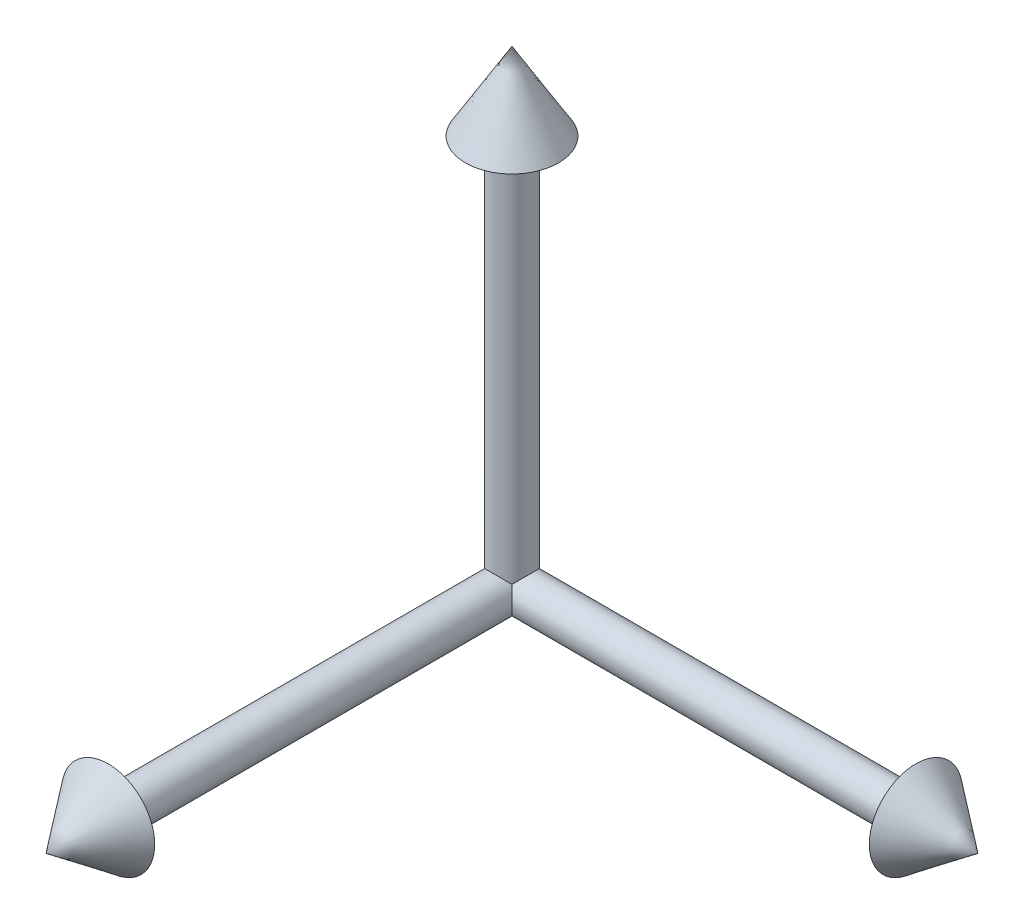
ISO-10303-21;
HEADER;
FILE_DESCRIPTION(('STEP AP214'),'2;1');
FILE_NAME('part.step','',(''),(''),'','','');
FILE_SCHEMA(('AUTOMOTIVE_DESIGN { 1 0 10303 214 1 1 1 1 }'));
ENDSEC;
DATA;
#1=APPLICATION_CONTEXT('core data for automotive mechanical design processes');
#2=APPLICATION_PROTOCOL_DEFINITION('international standard','automotive_design',2000,#1);
#3=PRODUCT_CONTEXT('',#1,'mechanical');
#4=PRODUCT('Part','Part','',(#3));
#5=PRODUCT_RELATED_PRODUCT_CATEGORY('part','',(#4));
#6=PRODUCT_DEFINITION_FORMATION('','',#4);
#7=PRODUCT_DEFINITION_CONTEXT('part definition',#1,'design');
#8=PRODUCT_DEFINITION('design','',#6,#7);
#9=PRODUCT_DEFINITION_SHAPE('','',#8);
#10=(LENGTH_UNIT() NAMED_UNIT(*) SI_UNIT(.MILLI.,.METRE.));
#11=(NAMED_UNIT(*) PLANE_ANGLE_UNIT() SI_UNIT($,.RADIAN.));
#12=(NAMED_UNIT(*) SI_UNIT($,.STERADIAN.) SOLID_ANGLE_UNIT());
#13=UNCERTAINTY_MEASURE_WITH_UNIT(LENGTH_MEASURE(1.E-05),#10,'distance_accuracy_value','');
#14=(GEOMETRIC_REPRESENTATION_CONTEXT(3) GLOBAL_UNCERTAINTY_ASSIGNED_CONTEXT((#13)) GLOBAL_UNIT_ASSIGNED_CONTEXT((#10,
#11,#12)) REPRESENTATION_CONTEXT('',''));
#15=CARTESIAN_POINT('',(0.,0.,0.));
#16=DIRECTION('',(0.,0.,1.));
#17=DIRECTION('',(1.,0.,0.));
#18=AXIS2_PLACEMENT_3D('',#15,#16,#17);
#19=CARTESIAN_POINT('',(3.17500000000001,0.,0.));
#20=DIRECTION('',(0.,1.,0.));
#21=DIRECTION('',(0.,0.,1.));
#22=AXIS2_PLACEMENT_3D('',#19,#20,#21);
#23=PLANE('',#22);
#24=DIRECTION('',(0.,0.,-1.));
#25=VECTOR('',#24,1.);
#26=CARTESIAN_POINT('',(0.,0.,0.));
#27=LINE('',#26,#25);
#28=CARTESIAN_POINT('',(0.,0.,0.));
#29=VERTEX_POINT('',#28);
#30=CARTESIAN_POINT('',(0.,0.,-3.17500000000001));
#31=VERTEX_POINT('',#30);
#32=EDGE_CURVE('E106',#29,#31,#27,.T.);
#33=ORIENTED_EDGE('',*,*,#32,.F.);
#34=DIRECTION('',(-1.,0.,0.));
#35=VECTOR('',#34,1.);
#36=CARTESIAN_POINT('',(3.17500000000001,0.,0.));
#37=LINE('',#36,#35);
#38=CARTESIAN_POINT('',(-3.17500000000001,0.,0.));
#39=VERTEX_POINT('',#38);
#40=EDGE_CURVE('E108',#29,#39,#37,.T.);
#41=ORIENTED_EDGE('',*,*,#40,.T.);
#42=CARTESIAN_POINT('',(0.,0.,0.));
#43=DIRECTION('',(0.,1.,0.));
#44=DIRECTION('',(0.,0.,1.));
#45=AXIS2_PLACEMENT_3D('',#42,#43,#44);
#46=CIRCLE('',#45,3.17500000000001);
#47=EDGE_CURVE('E110',#31,#39,#46,.T.);
#48=ORIENTED_EDGE('',*,*,#47,.F.);
#49=EDGE_LOOP('',(#33,#41,#48));
#50=FACE_BOUND('',#49,.T.);
#51=ADVANCED_FACE('F44',(#50),#23,.F.);
#52=CARTESIAN_POINT('',(0.,105.261261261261,0.));
#53=DIRECTION('',(0.,1.,0.));
#54=DIRECTION('',(0.,0.,1.));
#55=AXIS2_PLACEMENT_3D('',#52,#53,#54);
#56=CYLINDRICAL_SURFACE('',#55,3.17500000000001);
#57=CARTESIAN_POINT('',(0.,63.5,0.));
#58=DIRECTION('',(0.,1.,0.));
#59=DIRECTION('',(0.,0.,1.));
#60=AXIS2_PLACEMENT_3D('',#57,#58,#59);
#61=CIRCLE('',#60,3.17500000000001);
#62=CARTESIAN_POINT('',(0.,63.5,3.17500000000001));
#63=VERTEX_POINT('',#62);
#64=EDGE_CURVE('E123',#63,#63,#61,.T.);
#65=ORIENTED_EDGE('',*,*,#64,.F.);
#66=EDGE_LOOP('',(#65));
#67=FACE_BOUND('',#66,.T.);
#68=CARTESIAN_POINT('',(0.,0.,0.));
#69=DIRECTION('',(-0.707106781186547,0.707106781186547,0.));
#70=DIRECTION('',(0.707106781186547,0.707106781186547,0.));
#71=AXIS2_PLACEMENT_3D('',#68,#69,#70);
#72=ELLIPSE('',#71,4.49012806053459,3.17500000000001);
#73=CARTESIAN_POINT('',(2.24506403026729,2.24506403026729,2.24506403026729));
#74=VERTEX_POINT('',#73);
#75=EDGE_CURVE('E135',#31,#74,#72,.F.);
#76=ORIENTED_EDGE('',*,*,#75,.F.);
#77=ORIENTED_EDGE('',*,*,#47,.T.);
#78=CARTESIAN_POINT('',(0.,0.,0.));
#79=DIRECTION('',(0.,0.707106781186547,-0.707106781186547));
#80=DIRECTION('',(0.,0.707106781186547,0.707106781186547));
#81=AXIS2_PLACEMENT_3D('',#78,#79,#80);
#82=ELLIPSE('',#81,4.49012806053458,3.175);
#83=EDGE_CURVE('E51',#39,#74,#82,.T.);
#84=ORIENTED_EDGE('',*,*,#83,.T.);
#85=EDGE_LOOP('',(#76,#77,#84));
#86=FACE_BOUND('',#85,.T.);
#87=ADVANCED_FACE('F96',(#67,#86),#56,.T.);
#88=CARTESIAN_POINT('',(0.,0.,0.));
#89=DIRECTION('',(0.,0.,-1.));
#90=DIRECTION('',(-1.,0.,0.));
#91=AXIS2_PLACEMENT_3D('',#88,#89,#90);
#92=CYLINDRICAL_SURFACE('',#91,3.175);
#93=CARTESIAN_POINT('',(0.,0.,66.04));
#94=DIRECTION('',(0.,0.,-1.));
#95=DIRECTION('',(-1.,0.,0.));
#96=AXIS2_PLACEMENT_3D('',#93,#94,#95);
#97=CIRCLE('',#96,3.17499999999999);
#98=CARTESIAN_POINT('',(-3.17499999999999,0.,66.04));
#99=VERTEX_POINT('',#98);
#100=EDGE_CURVE('E126',#99,#99,#97,.T.);
#101=ORIENTED_EDGE('',*,*,#100,.T.);
#102=EDGE_LOOP('',(#101));
#103=FACE_BOUND('',#102,.T.);
#104=CARTESIAN_POINT('',(0.,0.,0.));
#105=DIRECTION('',(0.,0.,-1.));
#106=DIRECTION('',(-1.,0.,0.));
#107=AXIS2_PLACEMENT_3D('',#104,#105,#106);
#108=CIRCLE('',#107,3.175);
#109=CARTESIAN_POINT('',(0.,-3.175,0.));
#110=VERTEX_POINT('',#109);
#111=EDGE_CURVE('E118',#110,#39,#108,.T.);
#112=ORIENTED_EDGE('',*,*,#111,.F.);
#113=CARTESIAN_POINT('',(0.,0.,0.));
#114=DIRECTION('',(0.707106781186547,0.,-0.707106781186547));
#115=DIRECTION('',(-0.707106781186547,0.,-0.707106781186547));
#116=AXIS2_PLACEMENT_3D('',#113,#114,#115);
#117=ELLIPSE('',#116,4.49012806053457,3.175);
#118=EDGE_CURVE('E111',#110,#74,#117,.F.);
#119=ORIENTED_EDGE('',*,*,#118,.T.);
#120=ORIENTED_EDGE('',*,*,#83,.F.);
#121=EDGE_LOOP('',(#112,#119,#120));
#122=FACE_BOUND('',#121,.T.);
#123=ADVANCED_FACE('F101',(#103,#122),#92,.T.);
#124=CARTESIAN_POINT('',(0.,3.175,0.));
#125=DIRECTION('',(0.,0.,-1.));
#126=DIRECTION('',(-1.,0.,0.));
#127=AXIS2_PLACEMENT_3D('',#124,#125,#126);
#128=PLANE('',#127);
#129=ORIENTED_EDGE('',*,*,#40,.F.);
#130=DIRECTION('',(0.,-1.,0.));
#131=VECTOR('',#130,1.);
#132=CARTESIAN_POINT('',(0.,3.175,0.));
#133=LINE('',#132,#131);
#134=EDGE_CURVE('E13',#29,#110,#133,.T.);
#135=ORIENTED_EDGE('',*,*,#134,.T.);
#136=ORIENTED_EDGE('',*,*,#111,.T.);
#137=EDGE_LOOP('',(#129,#135,#136));
#138=FACE_BOUND('',#137,.T.);
#139=ADVANCED_FACE('F116',(#138),#128,.T.);
#140=CARTESIAN_POINT('',(3.17500000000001,63.5,0.));
#141=DIRECTION('',(0.,1.,0.));
#142=DIRECTION('',(0.,0.,1.));
#143=AXIS2_PLACEMENT_3D('',#140,#141,#142);
#144=PLANE('',#143);
#145=CARTESIAN_POINT('',(0.,63.5,0.));
#146=DIRECTION('',(0.,1.,0.));
#147=DIRECTION('',(0.,0.,1.));
#148=AXIS2_PLACEMENT_3D('',#145,#146,#147);
#149=CIRCLE('',#148,7.62000000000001);
#150=CARTESIAN_POINT('',(0.,63.5,7.62000000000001));
#151=VERTEX_POINT('',#150);
#152=EDGE_CURVE('E119',#151,#151,#149,.T.);
#153=ORIENTED_EDGE('',*,*,#152,.F.);
#154=EDGE_LOOP('',(#153));
#155=FACE_BOUND('',#154,.T.);
#156=ORIENTED_EDGE('',*,*,#64,.T.);
#157=EDGE_LOOP('',(#156));
#158=FACE_BOUND('',#157,.T.);
#159=ADVANCED_FACE('F165',(#155,#158),#144,.F.);
#160=CARTESIAN_POINT('',(0.,63.5,0.));
#161=DIRECTION('',(0.,-1.,0.));
#162=DIRECTION('',(0.,0.,-1.));
#163=AXIS2_PLACEMENT_3D('',#160,#161,#162);
#164=CONICAL_SURFACE('',#163,7.62000000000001,0.540419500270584);
#165=CARTESIAN_POINT('',(0.,76.2,0.));
#166=VERTEX_POINT('',#165);
#167=VERTEX_LOOP('',#166);
#168=FACE_BOUND('',#167,.T.);
#169=ORIENTED_EDGE('',*,*,#152,.T.);
#170=EDGE_LOOP('',(#169));
#171=FACE_BOUND('',#170,.T.);
#172=ADVANCED_FACE('F158',(#168,#171),#164,.T.);
#173=CARTESIAN_POINT('',(0.,0.,66.04));
#174=DIRECTION('',(0.,0.,-1.));
#175=DIRECTION('',(-1.,0.,0.));
#176=AXIS2_PLACEMENT_3D('',#173,#174,#175);
#177=CONICAL_SURFACE('',#176,7.61999999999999,0.643501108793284);
#178=CARTESIAN_POINT('',(0.,0.,76.2));
#179=VERTEX_POINT('',#178);
#180=VERTEX_LOOP('',#179);
#181=FACE_BOUND('',#180,.T.);
#182=CARTESIAN_POINT('',(0.,0.,66.04));
#183=DIRECTION('',(0.,0.,-1.));
#184=DIRECTION('',(-1.,0.,0.));
#185=AXIS2_PLACEMENT_3D('',#182,#183,#184);
#186=CIRCLE('',#185,7.61999999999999);
#187=CARTESIAN_POINT('',(-7.61999999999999,0.,66.04));
#188=VERTEX_POINT('',#187);
#189=EDGE_CURVE('E120',#188,#188,#186,.T.);
#190=ORIENTED_EDGE('',*,*,#189,.F.);
#191=EDGE_LOOP('',(#190));
#192=FACE_BOUND('',#191,.T.);
#193=ADVANCED_FACE('F149',(#181,#192),#177,.T.);
#194=CARTESIAN_POINT('',(0.,3.17499999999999,66.04));
#195=DIRECTION('',(0.,0.,-1.));
#196=DIRECTION('',(-1.,0.,0.));
#197=AXIS2_PLACEMENT_3D('',#194,#195,#196);
#198=PLANE('',#197);
#199=ORIENTED_EDGE('',*,*,#189,.T.);
#200=EDGE_LOOP('',(#199));
#201=FACE_BOUND('',#200,.T.);
#202=ORIENTED_EDGE('',*,*,#100,.F.);
#203=EDGE_LOOP('',(#202));
#204=FACE_BOUND('',#203,.T.);
#205=ADVANCED_FACE('F147',(#201,#204),#198,.T.);
#206=CARTESIAN_POINT('',(0.,0.,0.));
#207=DIRECTION('',(-1.,0.,0.));
#208=DIRECTION('',(0.,0.,1.));
#209=AXIS2_PLACEMENT_3D('',#206,#207,#208);
#210=CYLINDRICAL_SURFACE('',#209,3.175);
#211=CARTESIAN_POINT('',(66.04,0.,0.));
#212=DIRECTION('',(-1.,0.,0.));
#213=DIRECTION('',(0.,0.,1.));
#214=AXIS2_PLACEMENT_3D('',#211,#212,#213);
#215=CIRCLE('',#214,3.175);
#216=CARTESIAN_POINT('',(66.04,0.,3.175));
#217=VERTEX_POINT('',#216);
#218=EDGE_CURVE('E244',#217,#217,#215,.T.);
#219=ORIENTED_EDGE('',*,*,#218,.T.);
#220=EDGE_LOOP('',(#219));
#221=FACE_BOUND('',#220,.T.);
#222=CARTESIAN_POINT('',(0.,0.,0.));
#223=DIRECTION('',(-1.,0.,0.));
#224=DIRECTION('',(0.,0.,1.));
#225=AXIS2_PLACEMENT_3D('',#222,#223,#224);
#226=CIRCLE('',#225,3.175);
#227=EDGE_CURVE('E58',#31,#110,#226,.T.);
#228=ORIENTED_EDGE('',*,*,#227,.F.);
#229=ORIENTED_EDGE('',*,*,#75,.T.);
#230=ORIENTED_EDGE('',*,*,#118,.F.);
#231=EDGE_LOOP('',(#228,#229,#230));
#232=FACE_BOUND('',#231,.T.);
#233=ADVANCED_FACE('F91',(#221,#232),#210,.T.);
#234=CARTESIAN_POINT('',(0.,3.175,0.));
#235=DIRECTION('',(1.,0.,0.));
#236=DIRECTION('',(0.,0.,-1.));
#237=AXIS2_PLACEMENT_3D('',#234,#235,#236);
#238=PLANE('',#237);
#239=ORIENTED_EDGE('',*,*,#134,.F.);
#240=ORIENTED_EDGE('',*,*,#32,.T.);
#241=ORIENTED_EDGE('',*,*,#227,.T.);
#242=EDGE_LOOP('',(#239,#240,#241));
#243=FACE_BOUND('',#242,.T.);
#244=ADVANCED_FACE('F82',(#243),#238,.F.);
#245=CARTESIAN_POINT('',(76.2,0.,0.));
#246=DIRECTION('',(-1.,0.,0.));
#247=DIRECTION('',(0.,0.,1.));
#248=AXIS2_PLACEMENT_3D('',#245,#246,#247);
#249=CONICAL_SURFACE('',#248,0.,0.643501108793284);
#250=CARTESIAN_POINT('',(66.04,0.,0.));
#251=DIRECTION('',(-1.,0.,0.));
#252=DIRECTION('',(0.,0.,1.));
#253=AXIS2_PLACEMENT_3D('',#250,#251,#252);
#254=CIRCLE('',#253,7.62);
#255=CARTESIAN_POINT('',(66.04,0.,7.62));
#256=VERTEX_POINT('',#255);
#257=EDGE_CURVE('E112',#256,#256,#254,.T.);
#258=ORIENTED_EDGE('',*,*,#257,.F.);
#259=EDGE_LOOP('',(#258));
#260=FACE_BOUND('',#259,.T.);
#261=CARTESIAN_POINT('',(76.2,0.,0.));
#262=VERTEX_POINT('',#261);
#263=VERTEX_LOOP('',#262);
#264=FACE_BOUND('',#263,.T.);
#265=ADVANCED_FACE('F79',(#260,#264),#249,.T.);
#266=CARTESIAN_POINT('',(66.04,3.175,0.));
#267=DIRECTION('',(1.,0.,0.));
#268=DIRECTION('',(0.,0.,-1.));
#269=AXIS2_PLACEMENT_3D('',#266,#267,#268);
#270=PLANE('',#269);
#271=ORIENTED_EDGE('',*,*,#218,.F.);
#272=EDGE_LOOP('',(#271));
#273=FACE_BOUND('',#272,.T.);
#274=ORIENTED_EDGE('',*,*,#257,.T.);
#275=EDGE_LOOP('',(#274));
#276=FACE_BOUND('',#275,.T.);
#277=ADVANCED_FACE('F81',(#273,#276),#270,.F.);
#278=CLOSED_SHELL('',(#51,#87,#123,#139,#159,#172,#193,#205,#233,#244,#265,#277));
#279=MANIFOLD_SOLID_BREP('B2',#278);
#280=ADVANCED_BREP_SHAPE_REPRESENTATION('',(#18,#279),#14);
#281=SHAPE_DEFINITION_REPRESENTATION(#9,#280);
ENDSEC;
END-ISO-10303-21;
